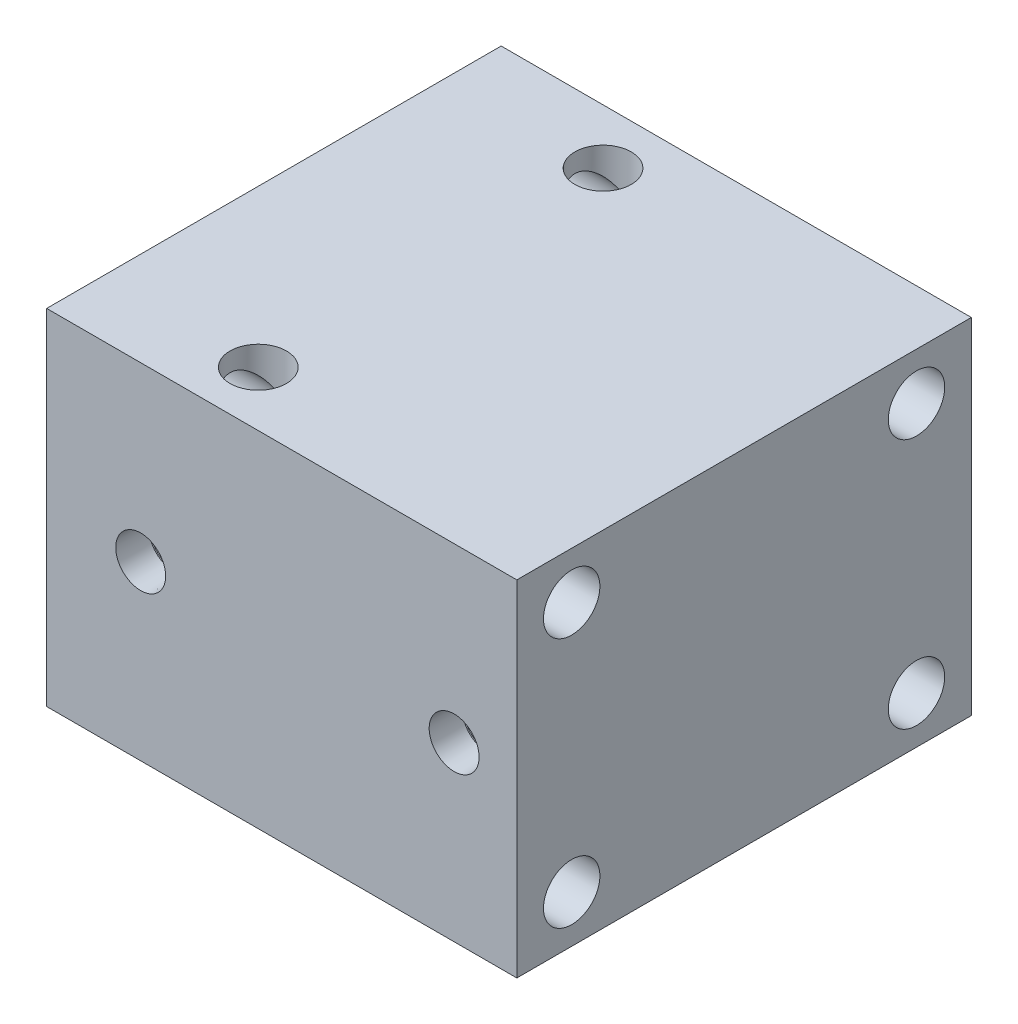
from build123d import *

# Parameters (mm, degrees)
SKETCH1_W                         = 150
SKETCH1_H                         = 145
SKETCH1_R                         = 9
EXTRUDE_H1_DEPTH                  = 110
SKETCH2_R                         = 1.5
CENTER_HOLE_DEPTH                 = 60
F_3_8_NPT_TAPPED_HOLE1_AT_2_COUNT = 2
F_3_8_NPT_TAPPED_HOLE1_AT_2_PITCH = 100
MTG_HOLE_REACH                    = 201.64
SKETCH6_R                         = 9
SKETCH5_R                         = 2
OIL_HOLE_DEPTH                    = 30


with BuildPart() as part:
    # Sketch1 → Extrude H1 (new body)
    with BuildSketch(Plane(origin=(0, 0, 0), x_dir=(1, 0, 0), z_dir=(0, 1, 0))):
        Rectangle(SKETCH1_W, SKETCH1_H)
        with Locations(Location((-25, 55, 0), (0, 0, 270))):
            Circle(SKETCH1_R, mode=Mode.SUBTRACT)
        with Locations(Location((-25, -55, 0), (0, 0, 270))):
            Circle(SKETCH1_R, mode=Mode.SUBTRACT)
    extrude(amount=EXTRUDE_H1_DEPTH)

    # Sketch2 → CENTER HOLE (cut)
    with BuildSketch(Plane.ZY.offset(75)):
        with Locations((0, 55)):
            Circle(SKETCH2_R)
    extrude(amount=-CENTER_HOLE_DEPTH, mode=Mode.SUBTRACT)

    # Sketch3 → 3_8 NPT Tapped Hole1 (revolve, cut)
    with BuildSketch(Plane(origin=(55, 55, 72.5), x_dir=(0, -1, 0), z_dir=(1, 0, 0))):
        Polygon((0, 0), (0, 21.668582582), (7.1374, 17.38), (7.1374, 10.33), (7.653732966, 10.33), (7.963027, 0), align=None)
    f_3_8_npt_tapped_hole1 = revolve(axis=Axis((55, 55, 78.85), (0, 0, -1)), mode=Mode.SUBTRACT)

    # 3_8 NPT Tapped Hole1 at 2: 3_8 NPT Tapped Hole1 ×2
    with Locations(*[(-i * F_3_8_NPT_TAPPED_HOLE1_AT_2_PITCH, 0, 0) for i in range(1, F_3_8_NPT_TAPPED_HOLE1_AT_2_COUNT)]):
        add(f_3_8_npt_tapped_hole1, mode=Mode.SUBTRACT)

    # MTG HOLE: up to this face of the body (flat: up to its plane)
    mtg_hole_end = Plane(part.part.faces().sort_by_distance((75, 55, 0))[0])
    # Sketch6 → MTG HOLE (cut, up to the picked face)
    with BuildSketch(Plane.ZY.offset(75), mode=Mode.PRIVATE) as mtg_hole_sk1:
        with Locations((-55, 95)):
            Circle(SKETCH6_R)
    mtg_hole_tool1 = split(extrude(mtg_hole_sk1.sketch, amount=-MTG_HOLE_REACH, mode=Mode.PRIVATE), bisect_by=mtg_hole_end, keep=Keep.BOTH, mode=Mode.PRIVATE)
    # Sketch6 → MTG HOLE (cut, up to the picked face)
    with BuildSketch(Plane.ZY.offset(75), mode=Mode.PRIVATE) as mtg_hole_sk2:
        with Locations((-55, 15)):
            Circle(SKETCH6_R)
    mtg_hole_tool2 = split(extrude(mtg_hole_sk2.sketch, amount=-MTG_HOLE_REACH, mode=Mode.PRIVATE), bisect_by=mtg_hole_end, keep=Keep.BOTH, mode=Mode.PRIVATE)
    # Sketch6 → MTG HOLE (cut, up to the picked face)
    with BuildSketch(Plane.ZY.offset(75), mode=Mode.PRIVATE) as mtg_hole_sk3:
        with Locations((55, 95)):
            Circle(SKETCH6_R)
    mtg_hole_tool3 = split(extrude(mtg_hole_sk3.sketch, amount=-MTG_HOLE_REACH, mode=Mode.PRIVATE), bisect_by=mtg_hole_end, keep=Keep.BOTH, mode=Mode.PRIVATE)
    # Sketch6 → MTG HOLE (cut, up to the picked face)
    with BuildSketch(Plane.ZY.offset(75), mode=Mode.PRIVATE) as mtg_hole_sk4:
        with Locations((55, 15)):
            Circle(SKETCH6_R)
    mtg_hole_tool4 = split(extrude(mtg_hole_sk4.sketch, amount=-MTG_HOLE_REACH, mode=Mode.PRIVATE), bisect_by=mtg_hole_end, keep=Keep.BOTH, mode=Mode.PRIVATE)
    add(mtg_hole_tool1.solids().sort_by(Axis((-75, 95, -55), (1, 0, 0)))[0], mode=Mode.SUBTRACT)
    add(mtg_hole_tool2.solids().sort_by(Axis((-75, 15, -55), (1, 0, 0)))[0], mode=Mode.SUBTRACT)
    add(mtg_hole_tool3.solids().sort_by(Axis((-75, 95, 55), (1, 0, 0)))[0], mode=Mode.SUBTRACT)
    add(mtg_hole_tool4.solids().sort_by(Axis((-75, 15, 55), (1, 0, 0)))[0], mode=Mode.SUBTRACT)

    # Sketch5 → OIL HOLE (cut)
    with BuildSketch(Plane.XY.offset(72.5)):
        with Locations((-45, 55)):
            Circle(SKETCH5_R)
        with Locations((55, 55)):
            Circle(SKETCH5_R)
    extrude(amount=-OIL_HOLE_DEPTH, mode=Mode.SUBTRACT)


solid = part.part
